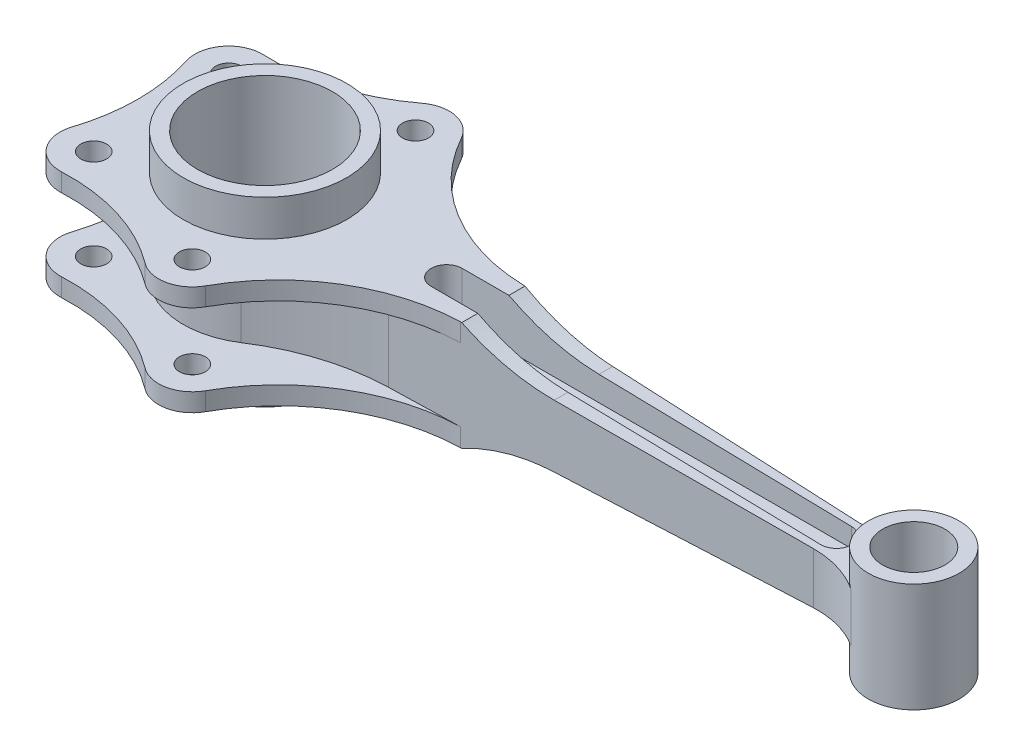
from build123d import *

# Parameters (mm, degrees)
SKETCH1_R               = 31.5
BOSS_EXTRUDE1_DEPTH     = 35
SKETCH2_R               = 17.5
BOSS_EXTRUDE2_DEPTH     = 21
BOSS_EXTRUDE3_DEPTH     = 21
BOSS_EXTRUDE4_DEPTH     = 7
CUT_EXTRUDE1_START      = 2.5
CUT_EXTRUDE1_DEPTH      = 274.030851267
CUT_EXTRUDE2_DEPTH      = 276.530851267
SKETCH7_R               = 17.5
BOSS_EXTRUDE5_DEPTH     = 21
CUT_EXTRUDE3_DEPTH      = 276.530851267
CUT_EXTRUDE3_DEPTH_BACK = 276.530851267
SKETCH8_R               = 26
SKETCH8_R_2             = 12


with BuildPart() as part:
    # Sketch1 → Boss-Extrude1 (new body)
    with BuildSketch(Plane(origin=(0, 0, 0), x_dir=(1, 0, 0), z_dir=(0, 1, 0))):
        with Locations(Location((0, 0, 0), (0, 0, 270))):
            Circle(SKETCH1_R)
    boss_extrude1 = extrude(amount=BOSS_EXTRUDE1_DEPTH)



with BuildPart() as body_2:
    # Sketch2 → Boss-Extrude2 (new body)
    with BuildSketch(Plane(origin=(0, 0, 0), x_dir=(1, 0, 0), z_dir=(0, 1, 0))):
        with Locations(Location((250, 0, 0), (0, 0, 90))):
            Circle(SKETCH2_R)
    extrude(amount=BOSS_EXTRUDE2_DEPTH)


with BuildPart() as part_1:
    add(part.part)

    add(body_2.part)  # Boss-Extrude3 merges body 2
    # Sketch3 → Boss-Extrude3 (add)
    with BuildSketch(Plane(origin=(0, 0, 0), x_dir=(1, 0, 0), z_dir=(0, 1, 0))):
        with BuildLine():
            Line((220, 8.719912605), (60.430871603, 12.898377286))
            ThreePointArc((60.430871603, 12.898377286), (37.890504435, 16.634432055), (17.222812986, 26.374698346))
            ThreePointArc((17.222812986, 26.374698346), (-31.5, 0), (17.222812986, -26.374698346))
            ThreePointArc((17.222812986, -26.374698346), (37.890504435, -16.634432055), (60.430871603, -12.898377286))
            Line((60.430871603, -12.898377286), (220, -8.719912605))
            ThreePointArc((220, -8.719912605), (230.604685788, -10.075596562), (240.30539773, -14.569306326))
            ThreePointArc((240.30539773, -14.569306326), (267.5, 0), (240.30539773, 14.569306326))
            ThreePointArc((240.30539773, 14.569306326), (230.604685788, 10.075596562), (220, 8.719912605))
        make_face()
    boss_extrude3 = extrude(amount=BOSS_EXTRUDE3_DEPTH)

    # Sketch6 → Boss-Extrude4 (add)
    with BuildSketch(Plane(origin=(0, 21, 0), x_dir=(1, 0, 0), z_dir=(0, 1, 0))):
        with BuildLine():
            Line((87.482015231, 12.190018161), (87.482015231, -12.190018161))
            ThreePointArc((87.482015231, -12.190018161), (51.997088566, -22.622612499), (26.373739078, -49.29587638))
            ThreePointArc((26.373739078, -49.29587638), (17.709961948, -55.714405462), (7.181946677, -53.386435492))
            ThreePointArc((7.181946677, -53.386435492), (-14.855989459, -42.122318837), (-39.406288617, -38.986435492))
            ThreePointArc((-39.406288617, -38.986435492), (-50.326951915, -33.896458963), (-52.376901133, -22.023529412))
            ThreePointArc((-52.376901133, -22.023529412), (-48.925892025, 0), (-52.376901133, 22.023529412))
            ThreePointArc((-52.376901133, 22.023529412), (-50.326951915, 33.896458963), (-39.406288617, 38.986435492))
            ThreePointArc((-39.406288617, 38.986435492), (-14.855989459, 42.122318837), (7.181946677, 53.386435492))
            ThreePointArc((7.181946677, 53.386435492), (17.709961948, 55.714405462), (26.373739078, 49.29587638))
            ThreePointArc((26.373739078, 49.29587638), (51.997088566, 22.622612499), (87.482015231, 12.190018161))
        make_face()
    boss_extrude4 = extrude(amount=-BOSS_EXTRUDE4_DEPTH)

    # Sketch4 → Cut-Extrude1 (cut, through all)
    with BuildSketch(Plane(origin=(0, 0, 0), x_dir=(1, 0, 0), z_dir=(0, 1, 0)).offset(CUT_EXTRUDE1_START)):
        with BuildLine():
            Line((70, 6), (220, 6))
            ThreePointArc((220, 6), (226, 0), (220, -6))
            Line((220, -6), (70, -6))
            ThreePointArc((70, -6), (64, 0), (70, 6))
        make_face()
    cut_extrude1 = extrude(amount=CUT_EXTRUDE1_DEPTH, mode=Mode.SUBTRACT)

    # Sketch5 → Cut-Extrude2 (cut, symmetric)
    with BuildSketch(Plane.XY):
        with BuildLine():
            Line((122.706696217, 12), (288, 8.393287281))
            Line((288, 8.393287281), (288, 21))
            Line((288, 21), (88, 21))
            ThreePointArc((88, 21), (104.829197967, 14.478720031), (122.706696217, 12))
        make_face()
    cut_extrude2 = extrude(amount=CUT_EXTRUDE2_DEPTH, both=True, mode=Mode.SUBTRACT)

    # Sketch7 → Boss-Extrude5 (add)
    with BuildSketch(Plane(origin=(0, 0, 0), x_dir=(1, 0, 0), z_dir=(0, 1, 0))):
        with Locations(Location((250, 0, 0), (0, 0, 123.640300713))):
            Circle(SKETCH7_R)
    boss_extrude5 = extrude(amount=BOSS_EXTRUDE5_DEPTH)

    # Sketch17 → 10.0 _10_ Diameter Hole2 (revolve, cut)
    with BuildSketch(Plane(origin=(15, 21, -43), x_dir=(0, 0, 1), z_dir=(1, 0, 0))):
        Polygon((0, 0), (0, 13.004303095), (5, 10), (5, 0), align=None)
    f_10_0_10_diameter_hole2 = revolve(axis=Axis((15, 27.35, -43), (0, -1, 0)), mode=Mode.SUBTRACT)

    # Sketch-Pattern1: 10.0 _10_ Diameter Hole2 at 3 more places
    with Locations((-55, 0, 17), (-55, 0, 69), (0, 0, 86)):
        add(f_10_0_10_diameter_hole2, mode=Mode.SUBTRACT)

    # Mirror1: Boss-Extrude1, Boss-Extrude3, Boss-Extrude4, Cut-Extrude1, Cut-Extrude2, Boss-Extrude5, 10.0 _10_ Diameter Hole2 across plane
    add(boss_extrude1.mirror(Plane.ZX))
    add(boss_extrude3.mirror(Plane.ZX))
    add(boss_extrude4.mirror(Plane.ZX))
    add(cut_extrude1.mirror(Plane.ZX), mode=Mode.SUBTRACT)
    add(cut_extrude2.mirror(Plane.ZX), mode=Mode.SUBTRACT)
    add(boss_extrude5.mirror(Plane.ZX))
    add(f_10_0_10_diameter_hole2.mirror(Plane.ZX), mode=Mode.SUBTRACT)

    # Mirror1 copy 1 sketch → Mirror1 copy 1 (revolve, cut)
    with BuildSketch(Plane(origin=(-40, -21, -26), x_dir=(0, 0, 1), z_dir=(1, 0, 0))):
        Polygon((0, 0), (0, -13.004303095), (5, -10), (5, 0), align=None)
    revolve(axis=Axis((-40, -27.35, -26), (0, -1, 0)), mode=Mode.SUBTRACT)

    # Mirror1 copy 2 sketch → Mirror1 copy 2 (revolve, cut)
    with BuildSketch(Plane(origin=(-40, -21, 26), x_dir=(0, 0, 1), z_dir=(1, 0, 0))):
        Polygon((0, 0), (0, -13.004303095), (5, -10), (5, 0), align=None)
    revolve(axis=Axis((-40, -27.35, 26), (0, -1, 0)), mode=Mode.SUBTRACT)

    # Mirror1 copy 3 sketch → Mirror1 copy 3 (revolve, cut)
    with BuildSketch(Plane(origin=(15, -21, 43), x_dir=(0, 0, 1), z_dir=(1, 0, 0))):
        Polygon((0, 0), (0, -13.004303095), (5, -10), (5, 0), align=None)
    revolve(axis=Axis((15, -27.35, 43), (0, -1, 0)), mode=Mode.SUBTRACT)

    # Sketch8 → Cut-Extrude3 (cut, two sides: drawn at the far end of the back side and taken through both)
    with BuildSketch(Plane(origin=(0, 0, 0), x_dir=(1, 0, 0), z_dir=(0, 1, 0)).offset(-CUT_EXTRUDE3_DEPTH_BACK)):
        with Locations(Location((0, 0, 0), (0, 0, 270))):
            Circle(SKETCH8_R)
        with Locations(Location((250, 0, 0), (0, 0, 270))):
            Circle(SKETCH8_R_2)
    extrude(amount=CUT_EXTRUDE3_DEPTH + CUT_EXTRUDE3_DEPTH_BACK, mode=Mode.SUBTRACT)


solid = part_1.part
